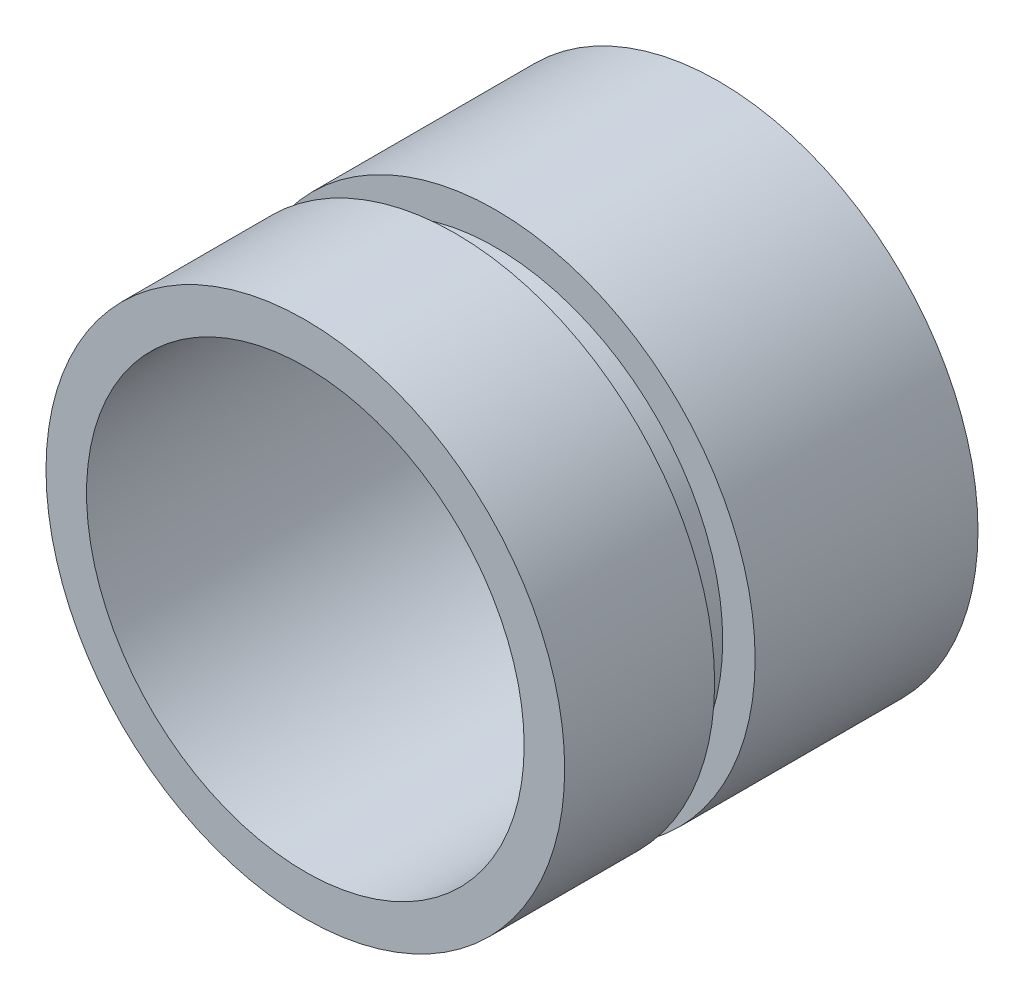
from build123d import *

# Parameters (mm, degrees)
ESQUISSE1_R          = 16
ESQUISSE1_R_2        = 13.5
BASE_EXTRUSION_DEPTH = 25.5
ESQUISSE2_W          = 2.5
ESQUISSE2_H          = 2.873233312


with BuildPart() as part:
    # Esquisse1 → Base-Extrusion (new body)
    with BuildSketch(Plane.XY):
        with Locations(Location((0, 0, 0), (0, 0, 180))):
            Circle(ESQUISSE1_R)
        Circle(ESQUISSE1_R_2, mode=Mode.SUBTRACT)
    extrude(amount=BASE_EXTRUSION_DEPTH)

    # Esquisse2 → Enl_vement de mati_re-R_volution1 (revolve, cut)
    with BuildSketch(Plane(origin=(0, 0, 0), x_dir=(0, 0, -1), z_dir=(1, 0, 0)), mode=Mode.PRIVATE) as enl_vement_de_mati_re_r_volution1_sk:
        with Locations((-15, 15.436616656)):
            Rectangle(ESQUISSE2_W, ESQUISSE2_H)
    revolve(enl_vement_de_mati_re_r_volution1_sk.sketch.rotate(Axis((0, 0, 27.64019352), (0, 0, -1)), 90), axis=Axis((0, 0, 27.64019352), (0, 0, -1)), mode=Mode.SUBTRACT)


solid = part.part
